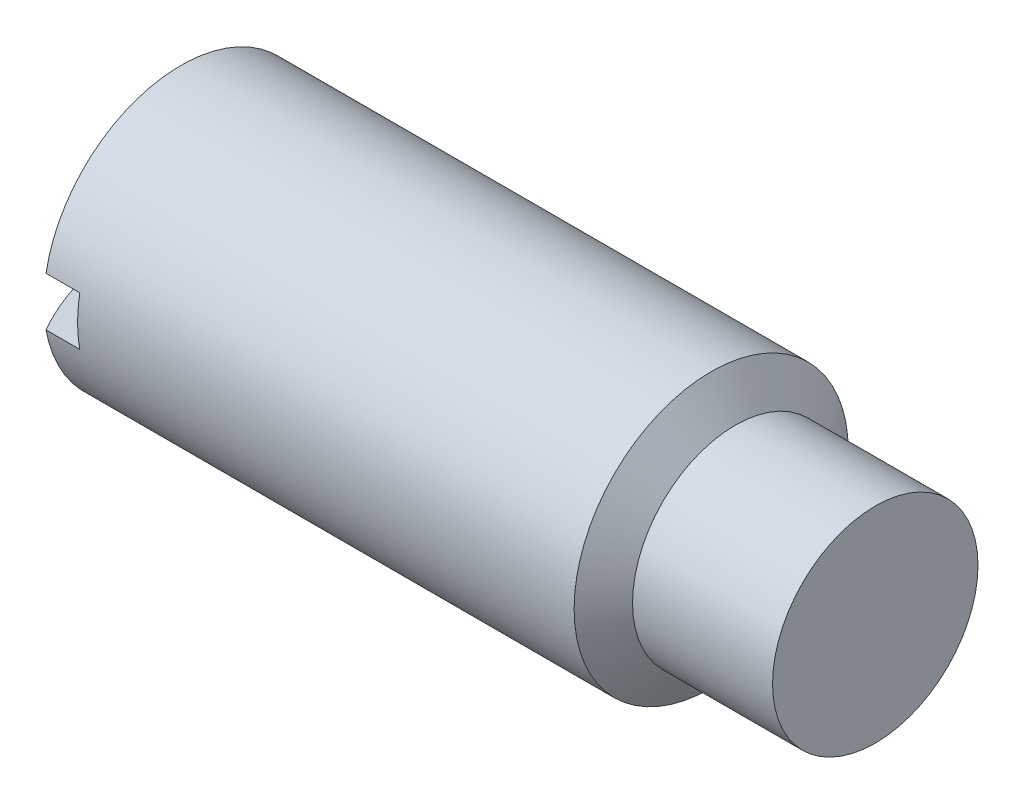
ISO-10303-21;
HEADER;
FILE_DESCRIPTION(('STEP AP214'),'2;1');
FILE_NAME('part.step','',(''),(''),'','','');
FILE_SCHEMA(('AUTOMOTIVE_DESIGN { 1 0 10303 214 1 1 1 1 }'));
ENDSEC;
DATA;
#1=APPLICATION_CONTEXT('core data for automotive mechanical design processes');
#2=APPLICATION_PROTOCOL_DEFINITION('international standard','automotive_design',2000,#1);
#3=PRODUCT_CONTEXT('',#1,'mechanical');
#4=PRODUCT('Part','Part','',(#3));
#5=PRODUCT_RELATED_PRODUCT_CATEGORY('part','',(#4));
#6=PRODUCT_DEFINITION_FORMATION('','',#4);
#7=PRODUCT_DEFINITION_CONTEXT('part definition',#1,'design');
#8=PRODUCT_DEFINITION('design','',#6,#7);
#9=PRODUCT_DEFINITION_SHAPE('','',#8);
#10=(LENGTH_UNIT() NAMED_UNIT(*) SI_UNIT(.MILLI.,.METRE.));
#11=(NAMED_UNIT(*) PLANE_ANGLE_UNIT() SI_UNIT($,.RADIAN.));
#12=(NAMED_UNIT(*) SI_UNIT($,.STERADIAN.) SOLID_ANGLE_UNIT());
#13=UNCERTAINTY_MEASURE_WITH_UNIT(LENGTH_MEASURE(1.E-05),#10,'distance_accuracy_value','');
#14=(GEOMETRIC_REPRESENTATION_CONTEXT(3) GLOBAL_UNCERTAINTY_ASSIGNED_CONTEXT((#13)) GLOBAL_UNIT_ASSIGNED_CONTEXT((#10,
#11,#12)) REPRESENTATION_CONTEXT('',''));
#15=CARTESIAN_POINT('',(0.,0.,0.));
#16=DIRECTION('',(0.,0.,1.));
#17=DIRECTION('',(1.,0.,0.));
#18=AXIS2_PLACEMENT_3D('',#15,#16,#17);
#19=CARTESIAN_POINT('',(19.05,0.,0.));
#20=DIRECTION('',(-1.,0.,0.));
#21=DIRECTION('',(0.,1.,0.));
#22=AXIS2_PLACEMENT_3D('',#19,#20,#21);
#23=SPHERICAL_SURFACE('',#22,19.05);
#24=CARTESIAN_POINT('',(19.05,1.7018,0.));
#25=DIRECTION('',(0.,-1.,0.));
#26=DIRECTION('',(0.,0.,-1.));
#27=AXIS2_PLACEMENT_3D('',#24,#25,#26);
#28=CIRCLE('',#27,18.9738340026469);
#29=CARTESIAN_POINT('',(2.55221605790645,1.7018,9.37173952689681));
#30=VERTEX_POINT('',#29);
#31=CARTESIAN_POINT('',(2.55221605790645,1.7018,-9.37173952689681));
#32=VERTEX_POINT('',#31);
#33=EDGE_CURVE('E94',#30,#32,#28,.T.);
#34=ORIENTED_EDGE('',*,*,#33,.F.);
#35=CARTESIAN_POINT('',(2.55221605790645,0.,0.));
#36=DIRECTION('',(-1.,0.,0.));
#37=DIRECTION('',(0.,0.,1.));
#38=AXIS2_PLACEMENT_3D('',#35,#36,#37);
#39=CIRCLE('',#38,9.525);
#40=EDGE_CURVE('E85',#30,#32,#39,.T.);
#41=ORIENTED_EDGE('',*,*,#40,.T.);
#42=EDGE_LOOP('',(#34,#41));
#43=FACE_BOUND('',#42,.T.);
#44=ADVANCED_FACE('F32',(#43),#23,.T.);
#45=CARTESIAN_POINT('',(19.05,-1.7018,0.));
#46=DIRECTION('',(0.,1.,0.));
#47=DIRECTION('',(0.,0.,1.));
#48=AXIS2_PLACEMENT_3D('',#45,#46,#47);
#49=CIRCLE('',#48,18.9738340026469);
#50=CARTESIAN_POINT('',(2.55221605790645,-1.7018,-9.37173952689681));
#51=VERTEX_POINT('',#50);
#52=CARTESIAN_POINT('',(2.55221605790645,-1.7018,9.37173952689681));
#53=VERTEX_POINT('',#52);
#54=EDGE_CURVE('E111',#51,#53,#49,.T.);
#55=ORIENTED_EDGE('',*,*,#54,.F.);
#56=EDGE_CURVE('E88',#51,#53,#39,.T.);
#57=ORIENTED_EDGE('',*,*,#56,.T.);
#58=EDGE_LOOP('',(#55,#57));
#59=FACE_BOUND('',#58,.T.);
#60=ADVANCED_FACE('F110',(#59),#23,.T.);
#61=CARTESIAN_POINT('',(-12.7,0.,0.));
#62=DIRECTION('',(-1.,0.,0.));
#63=DIRECTION('',(0.,0.,1.));
#64=AXIS2_PLACEMENT_3D('',#61,#62,#63);
#65=CYLINDRICAL_SURFACE('',#64,9.525);
#66=CARTESIAN_POINT('',(39.3999844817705,0.,0.));
#67=DIRECTION('',(-1.,0.,0.));
#68=DIRECTION('',(0.,0.,1.));
#69=AXIS2_PLACEMENT_3D('',#66,#67,#68);
#70=CIRCLE('',#69,9.525);
#71=CARTESIAN_POINT('',(39.3999844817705,0.,9.525));
#72=VERTEX_POINT('',#71);
#73=EDGE_CURVE('E87',#72,#72,#70,.T.);
#74=ORIENTED_EDGE('',*,*,#73,.T.);
#75=EDGE_LOOP('',(#74));
#76=FACE_BOUND('',#75,.T.);
#77=ORIENTED_EDGE('',*,*,#40,.F.);
#78=DIRECTION('',(-1.,0.,0.));
#79=VECTOR('',#78,1.);
#80=CARTESIAN_POINT('',(-12.7,1.7018,9.37173952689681));
#81=LINE('',#80,#79);
#82=CARTESIAN_POINT('',(4.9022,1.7018,9.37173952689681));
#83=VERTEX_POINT('',#82);
#84=EDGE_CURVE('E11',#30,#83,#81,.F.);
#85=ORIENTED_EDGE('',*,*,#84,.T.);
#86=CARTESIAN_POINT('',(4.9022,0.,0.));
#87=DIRECTION('',(1.,0.,0.));
#88=DIRECTION('',(0.,0.,-1.));
#89=AXIS2_PLACEMENT_3D('',#86,#87,#88);
#90=CIRCLE('',#89,9.525);
#91=CARTESIAN_POINT('',(4.9022,-1.7018,9.37173952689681));
#92=VERTEX_POINT('',#91);
#93=EDGE_CURVE('E68',#92,#83,#90,.F.);
#94=ORIENTED_EDGE('',*,*,#93,.F.);
#95=DIRECTION('',(-1.,0.,0.));
#96=VECTOR('',#95,1.);
#97=CARTESIAN_POINT('',(-12.7,-1.7018,9.37173952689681));
#98=LINE('',#97,#96);
#99=EDGE_CURVE('E39',#92,#53,#98,.T.);
#100=ORIENTED_EDGE('',*,*,#99,.T.);
#101=ORIENTED_EDGE('',*,*,#56,.F.);
#102=DIRECTION('',(-1.,0.,0.));
#103=VECTOR('',#102,1.);
#104=CARTESIAN_POINT('',(-12.7,-1.7018,-9.37173952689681));
#105=LINE('',#104,#103);
#106=CARTESIAN_POINT('',(4.9022,-1.7018,-9.37173952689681));
#107=VERTEX_POINT('',#106);
#108=EDGE_CURVE('E103',#51,#107,#105,.F.);
#109=ORIENTED_EDGE('',*,*,#108,.T.);
#110=CARTESIAN_POINT('',(4.9022,1.7018,-9.37173952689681));
#111=VERTEX_POINT('',#110);
#112=EDGE_CURVE('E77',#111,#107,#90,.F.);
#113=ORIENTED_EDGE('',*,*,#112,.F.);
#114=DIRECTION('',(-1.,0.,0.));
#115=VECTOR('',#114,1.);
#116=CARTESIAN_POINT('',(-12.7,1.7018,-9.37173952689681));
#117=LINE('',#116,#115);
#118=EDGE_CURVE('E75',#111,#32,#117,.T.);
#119=ORIENTED_EDGE('',*,*,#118,.T.);
#120=EDGE_LOOP('',(#77,#85,#94,#100,#101,#109,#113,#119));
#121=FACE_BOUND('',#120,.T.);
#122=ADVANCED_FACE('F83',(#76,#121),#65,.T.);
#123=CARTESIAN_POINT('',(50.8,7.1374,0.));
#124=DIRECTION('',(1.,0.,0.));
#125=DIRECTION('',(0.,0.,-1.));
#126=AXIS2_PLACEMENT_3D('',#123,#124,#125);
#127=PLANE('',#126);
#128=CARTESIAN_POINT('',(50.8,0.,0.));
#129=DIRECTION('',(-1.,0.,0.));
#130=DIRECTION('',(0.,0.,1.));
#131=AXIS2_PLACEMENT_3D('',#128,#129,#130);
#132=CIRCLE('',#131,7.1374);
#133=CARTESIAN_POINT('',(50.8,0.,7.1374));
#134=VERTEX_POINT('',#133);
#135=EDGE_CURVE('E100',#134,#134,#132,.T.);
#136=ORIENTED_EDGE('',*,*,#135,.F.);
#137=EDGE_LOOP('',(#136));
#138=FACE_BOUND('',#137,.T.);
#139=ADVANCED_FACE('F130',(#138),#127,.T.);
#140=CARTESIAN_POINT('',(-12.7,0.,0.));
#141=DIRECTION('',(-1.,0.,0.));
#142=DIRECTION('',(0.,0.,1.));
#143=AXIS2_PLACEMENT_3D('',#140,#141,#142);
#144=CYLINDRICAL_SURFACE('',#143,7.1374);
#145=ORIENTED_EDGE('',*,*,#135,.T.);
#146=EDGE_LOOP('',(#145));
#147=FACE_BOUND('',#146,.T.);
#148=CARTESIAN_POINT('',(41.0718,0.,0.));
#149=DIRECTION('',(-1.,0.,0.));
#150=DIRECTION('',(0.,0.,1.));
#151=AXIS2_PLACEMENT_3D('',#148,#149,#150);
#152=CIRCLE('',#151,7.1374);
#153=CARTESIAN_POINT('',(41.0718,0.,7.1374));
#154=VERTEX_POINT('',#153);
#155=EDGE_CURVE('E91',#154,#154,#152,.T.);
#156=ORIENTED_EDGE('',*,*,#155,.F.);
#157=EDGE_LOOP('',(#156));
#158=FACE_BOUND('',#157,.T.);
#159=ADVANCED_FACE('F136',(#147,#158),#144,.T.);
#160=CARTESIAN_POINT('',(41.0718,0.,0.));
#161=DIRECTION('',(-1.,0.,0.));
#162=DIRECTION('',(0.,0.,1.));
#163=AXIS2_PLACEMENT_3D('',#160,#161,#162);
#164=CONICAL_SURFACE('',#163,7.1374,0.959931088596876);
#165=ORIENTED_EDGE('',*,*,#73,.F.);
#166=EDGE_LOOP('',(#165));
#167=FACE_BOUND('',#166,.T.);
#168=ORIENTED_EDGE('',*,*,#155,.T.);
#169=EDGE_LOOP('',(#168));
#170=FACE_BOUND('',#169,.T.);
#171=ADVANCED_FACE('F121',(#167,#170),#164,.T.);
#172=CARTESIAN_POINT('',(4.9022,1.7018,-9.52499999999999));
#173=DIRECTION('',(0.,-1.,0.));
#174=DIRECTION('',(0.,0.,-1.));
#175=AXIS2_PLACEMENT_3D('',#172,#173,#174);
#176=PLANE('',#175);
#177=ORIENTED_EDGE('',*,*,#33,.T.);
#178=ORIENTED_EDGE('',*,*,#118,.F.);
#179=DIRECTION('',(0.,0.,1.));
#180=VECTOR('',#179,1.);
#181=CARTESIAN_POINT('',(4.9022,1.7018,-9.52499999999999));
#182=LINE('',#181,#180);
#183=EDGE_CURVE('E46',#111,#83,#182,.T.);
#184=ORIENTED_EDGE('',*,*,#183,.T.);
#185=ORIENTED_EDGE('',*,*,#84,.F.);
#186=EDGE_LOOP('',(#177,#178,#184,#185));
#187=FACE_BOUND('',#186,.T.);
#188=ADVANCED_FACE('F78',(#187),#176,.T.);
#189=CARTESIAN_POINT('',(4.9022,-1.7018,-9.52499999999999));
#190=DIRECTION('',(0.,1.,0.));
#191=DIRECTION('',(0.,0.,1.));
#192=AXIS2_PLACEMENT_3D('',#189,#190,#191);
#193=PLANE('',#192);
#194=ORIENTED_EDGE('',*,*,#54,.T.);
#195=ORIENTED_EDGE('',*,*,#99,.F.);
#196=DIRECTION('',(0.,0.,-1.));
#197=VECTOR('',#196,1.);
#198=CARTESIAN_POINT('',(4.9022,-1.7018,-9.52499999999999));
#199=LINE('',#198,#197);
#200=EDGE_CURVE('E71',#92,#107,#199,.T.);
#201=ORIENTED_EDGE('',*,*,#200,.T.);
#202=ORIENTED_EDGE('',*,*,#108,.F.);
#203=EDGE_LOOP('',(#194,#195,#201,#202));
#204=FACE_BOUND('',#203,.T.);
#205=ADVANCED_FACE('F113',(#204),#193,.T.);
#206=CARTESIAN_POINT('',(4.9022,1.7018,-9.52499999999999));
#207=DIRECTION('',(1.,0.,0.));
#208=DIRECTION('',(0.,0.,-1.));
#209=AXIS2_PLACEMENT_3D('',#206,#207,#208);
#210=PLANE('',#209);
#211=ORIENTED_EDGE('',*,*,#200,.F.);
#212=ORIENTED_EDGE('',*,*,#93,.T.);
#213=ORIENTED_EDGE('',*,*,#183,.F.);
#214=ORIENTED_EDGE('',*,*,#112,.T.);
#215=EDGE_LOOP('',(#211,#212,#213,#214));
#216=FACE_BOUND('',#215,.T.);
#217=ADVANCED_FACE('F69',(#216),#210,.F.);
#218=CLOSED_SHELL('',(#44,#60,#122,#139,#159,#171,#188,#205,#217));
#219=MANIFOLD_SOLID_BREP('B2',#218);
#220=ADVANCED_BREP_SHAPE_REPRESENTATION('',(#18,#219),#14);
#221=SHAPE_DEFINITION_REPRESENTATION(#9,#220);
ENDSEC;
END-ISO-10303-21;
